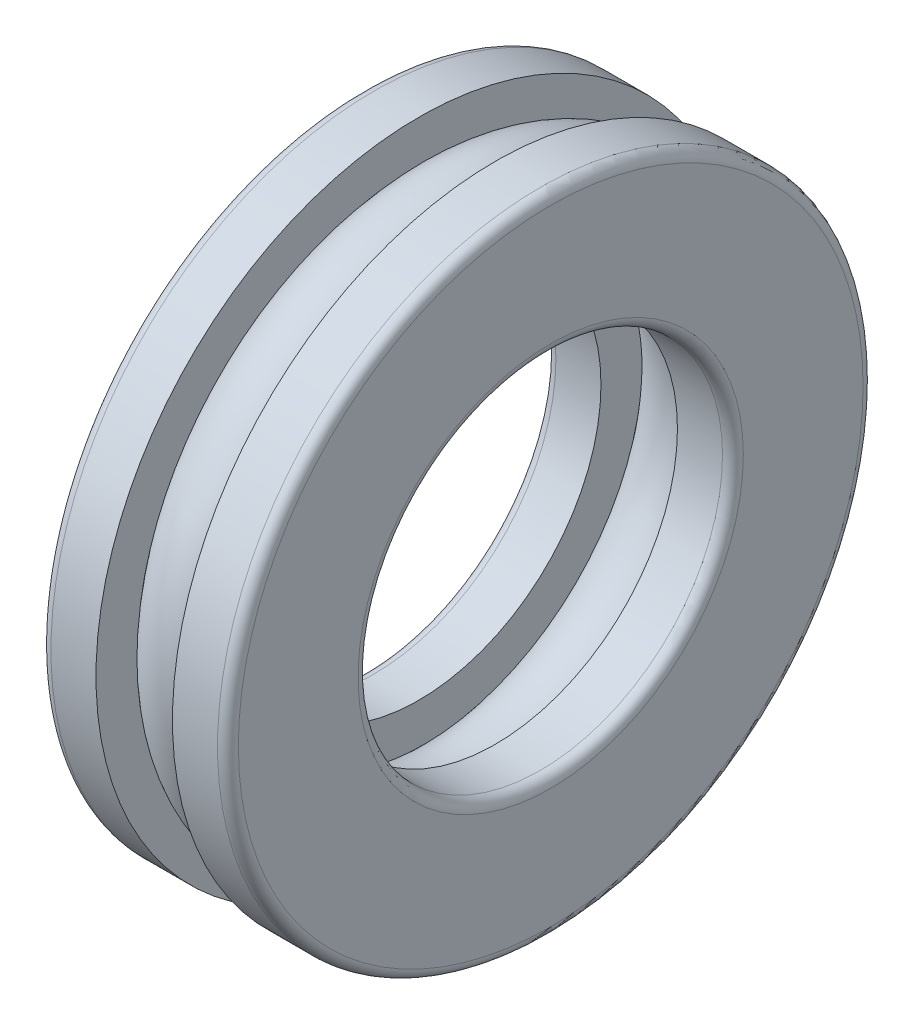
from build123d import *

# Parameters (mm, degrees)
BALSIMSKE_R = 4.59


with BuildPart() as part:
    # InnRacSke → Race (revolve)
    with BuildSketch(Plane.XY, mode=Mode.PRIVATE) as race_sk:
        with BuildLine():
            Line((-3.672, 21.5378715), (-3.672, 17.5))
            Line((-3.672, 17.5), (-8, 17.5))
            ThreePointArc((-8, 17.5), (-8.707106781, 17.792893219), (-9, 18.5))
            Line((-9, 18.5), (-9, 30))
            ThreePointArc((-9, 30), (-8.707106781, 30.707106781), (-8, 31))
            Line((-8, 31), (-3.672, 31))
            Line((-3.672, 31), (-3.672, 26.9621285))
            ThreePointArc((-3.672, 26.9621285), (-4.565, 24.25), (-3.672, 21.5378715))
        make_face()
    race = revolve(race_sk.sketch.rotate(Axis((-34.925, 0, 0), (1, 0, 0)), 270), axis=Axis((-34.925, 0, 0), (1, 0, 0)))

    # BalSimSke → BallsSimplified (revolve)
    with BuildSketch(Plane.XY, mode=Mode.PRIVATE) as ballssimplified_sk:
        with Locations((0, 24.25)):
            Circle(BALSIMSKE_R)
    revolve(ballssimplified_sk.sketch.rotate(Axis((-25.4, 0, 0), (1, 0, 0)), 90), axis=Axis((-25.4, 0, 0), (1, 0, 0)))

    # Mirror1: Race across plane
    add(race.mirror(Plane(origin=(0, 0, 0), x_dir=(0, 0, 1), z_dir=(1, 0, 0))))


solid = part.part
